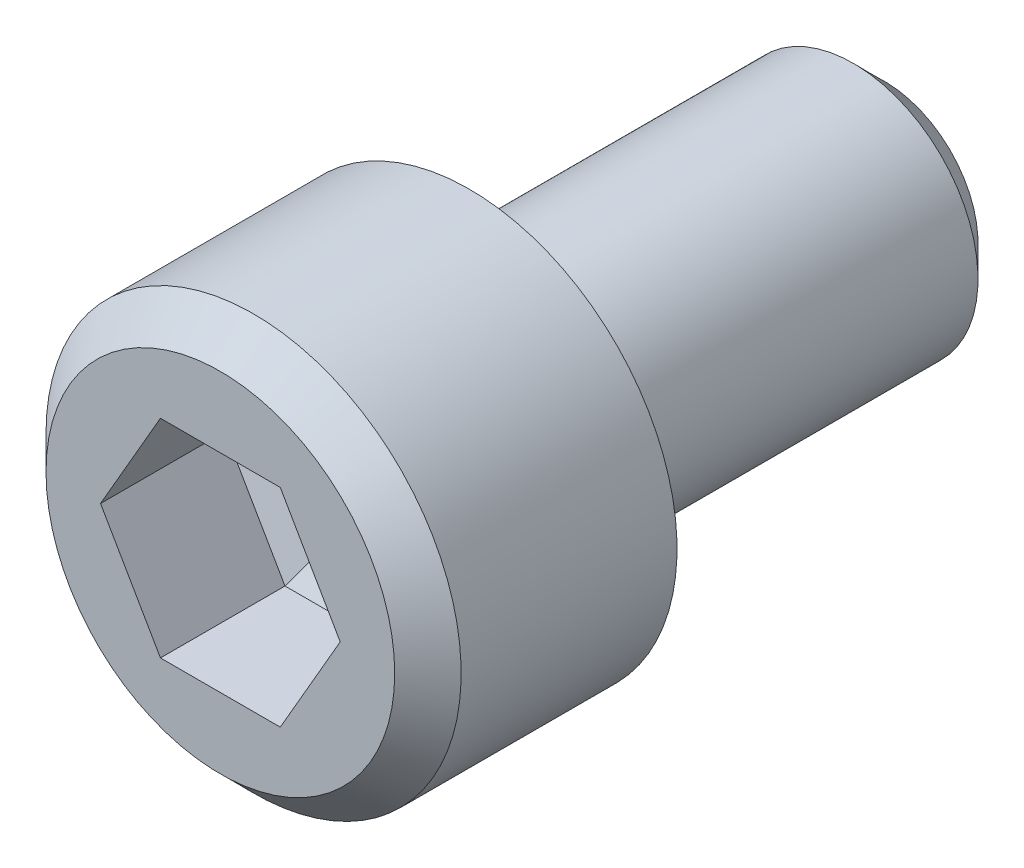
ISO-10303-21;
HEADER;
FILE_DESCRIPTION(('STEP AP214'),'2;1');
FILE_NAME('part.step','',(''),(''),'','','');
FILE_SCHEMA(('AUTOMOTIVE_DESIGN { 1 0 10303 214 1 1 1 1 }'));
ENDSEC;
DATA;
#1=APPLICATION_CONTEXT('core data for automotive mechanical design processes');
#2=APPLICATION_PROTOCOL_DEFINITION('international standard','automotive_design',2000,#1);
#3=PRODUCT_CONTEXT('',#1,'mechanical');
#4=PRODUCT('Part','Part','',(#3));
#5=PRODUCT_RELATED_PRODUCT_CATEGORY('part','',(#4));
#6=PRODUCT_DEFINITION_FORMATION('','',#4);
#7=PRODUCT_DEFINITION_CONTEXT('part definition',#1,'design');
#8=PRODUCT_DEFINITION('design','',#6,#7);
#9=PRODUCT_DEFINITION_SHAPE('','',#8);
#10=(LENGTH_UNIT() NAMED_UNIT(*) SI_UNIT(.MILLI.,.METRE.));
#11=(NAMED_UNIT(*) PLANE_ANGLE_UNIT() SI_UNIT($,.RADIAN.));
#12=(NAMED_UNIT(*) SI_UNIT($,.STERADIAN.) SOLID_ANGLE_UNIT());
#13=UNCERTAINTY_MEASURE_WITH_UNIT(LENGTH_MEASURE(1.E-05),#10,'distance_accuracy_value','');
#14=(GEOMETRIC_REPRESENTATION_CONTEXT(3) GLOBAL_UNCERTAINTY_ASSIGNED_CONTEXT((#13)) GLOBAL_UNIT_ASSIGNED_CONTEXT((#10,
#11,#12)) REPRESENTATION_CONTEXT('',''));
#15=CARTESIAN_POINT('',(0.,0.,0.));
#16=DIRECTION('',(0.,0.,1.));
#17=DIRECTION('',(1.,0.,0.));
#18=AXIS2_PLACEMENT_3D('',#15,#16,#17);
#19=CARTESIAN_POINT('',(37.5,1.7562446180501E-13,70.));
#20=DIRECTION('',(0.,0.,1.));
#21=DIRECTION('',(-1.,0.,0.));
#22=AXIS2_PLACEMENT_3D('',#19,#20,#21);
#23=PLANE('',#22);
#24=DIRECTION('',(-0.5,0.866025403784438,0.));
#25=VECTOR('',#24,1.);
#26=CARTESIAN_POINT('',(40.3867513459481,1.7562446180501E-13,70.));
#27=LINE('',#26,#25);
#28=CARTESIAN_POINT('',(40.3867513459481,1.7562446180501E-13,70.));
#29=VERTEX_POINT('',#28);
#30=CARTESIAN_POINT('',(38.9433756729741,2.50000000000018,70.));
#31=VERTEX_POINT('',#30);
#32=EDGE_CURVE('E291',#29,#31,#27,.T.);
#33=ORIENTED_EDGE('',*,*,#32,.F.);
#34=DIRECTION('',(0.5,0.866025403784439,0.));
#35=VECTOR('',#34,1.);
#36=CARTESIAN_POINT('',(38.9433756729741,-2.49999999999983,70.));
#37=LINE('',#36,#35);
#38=CARTESIAN_POINT('',(38.9433756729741,-2.49999999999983,70.));
#39=VERTEX_POINT('',#38);
#40=EDGE_CURVE('E88',#39,#29,#37,.T.);
#41=ORIENTED_EDGE('',*,*,#40,.F.);
#42=DIRECTION('',(1.,0.,0.));
#43=VECTOR('',#42,1.);
#44=CARTESIAN_POINT('',(36.056624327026,-2.49999999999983,70.));
#45=LINE('',#44,#43);
#46=CARTESIAN_POINT('',(36.056624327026,-2.49999999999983,70.));
#47=VERTEX_POINT('',#46);
#48=EDGE_CURVE('E31',#47,#39,#45,.T.);
#49=ORIENTED_EDGE('',*,*,#48,.F.);
#50=DIRECTION('',(0.5,-0.866025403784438,0.));
#51=VECTOR('',#50,1.);
#52=CARTESIAN_POINT('',(34.6132486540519,1.68963123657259E-13,70.));
#53=LINE('',#52,#51);
#54=CARTESIAN_POINT('',(34.6132486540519,1.68685567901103E-13,70.));
#55=VERTEX_POINT('',#54);
#56=EDGE_CURVE('E66',#55,#47,#53,.T.);
#57=ORIENTED_EDGE('',*,*,#56,.F.);
#58=DIRECTION('',(-0.5,-0.86602540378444,0.));
#59=VECTOR('',#58,1.);
#60=CARTESIAN_POINT('',(36.056624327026,2.50000000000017,70.));
#61=LINE('',#60,#59);
#62=CARTESIAN_POINT('',(36.056624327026,2.50000000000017,70.));
#63=VERTEX_POINT('',#62);
#64=EDGE_CURVE('E76',#63,#55,#61,.T.);
#65=ORIENTED_EDGE('',*,*,#64,.F.);
#66=DIRECTION('',(-1.,0.,0.));
#67=VECTOR('',#66,1.);
#68=CARTESIAN_POINT('',(38.9433756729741,2.50000000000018,70.));
#69=LINE('',#68,#67);
#70=EDGE_CURVE('E82',#31,#63,#69,.T.);
#71=ORIENTED_EDGE('',*,*,#70,.F.);
#72=EDGE_LOOP('',(#33,#41,#49,#57,#65,#71));
#73=FACE_BOUND('',#72,.T.);
#74=CARTESIAN_POINT('',(37.5,1.7562446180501E-13,70.));
#75=DIRECTION('',(0.,0.,1.));
#76=DIRECTION('',(-1.,0.,0.));
#77=AXIS2_PLACEMENT_3D('',#74,#75,#76);
#78=CIRCLE('',#77,4.2);
#79=CARTESIAN_POINT('',(33.3,1.7562446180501E-13,70.));
#80=VERTEX_POINT('',#79);
#81=EDGE_CURVE('E110',#80,#80,#78,.T.);
#82=ORIENTED_EDGE('',*,*,#81,.T.);
#83=EDGE_LOOP('',(#82));
#84=FACE_BOUND('',#83,.T.);
#85=ADVANCED_FACE('F16',(#73,#84),#23,.T.);
#86=CARTESIAN_POINT('',(37.5,1.7562446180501E-13,64.));
#87=DIRECTION('',(0.,0.,-1.));
#88=DIRECTION('',(1.,0.,0.));
#89=AXIS2_PLACEMENT_3D('',#86,#87,#88);
#90=PLANE('',#89);
#91=CARTESIAN_POINT('',(37.5,1.7562446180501E-13,64.));
#92=DIRECTION('',(0.,0.,-1.));
#93=DIRECTION('',(-1.,0.,0.));
#94=AXIS2_PLACEMENT_3D('',#91,#92,#93);
#95=CIRCLE('',#94,3.);
#96=CARTESIAN_POINT('',(34.5,1.7562446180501E-13,64.));
#97=VERTEX_POINT('',#96);
#98=EDGE_CURVE('E113',#97,#97,#95,.T.);
#99=ORIENTED_EDGE('',*,*,#98,.F.);
#100=EDGE_LOOP('',(#99));
#101=FACE_BOUND('',#100,.T.);
#102=CARTESIAN_POINT('',(37.5,1.7562446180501E-13,64.));
#103=DIRECTION('',(0.,0.,1.));
#104=DIRECTION('',(-1.,0.,0.));
#105=AXIS2_PLACEMENT_3D('',#102,#103,#104);
#106=CIRCLE('',#105,5.);
#107=CARTESIAN_POINT('',(32.5,1.7562446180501E-13,64.));
#108=VERTEX_POINT('',#107);
#109=EDGE_CURVE('E102',#108,#108,#106,.T.);
#110=ORIENTED_EDGE('',*,*,#109,.F.);
#111=EDGE_LOOP('',(#110));
#112=FACE_BOUND('',#111,.T.);
#113=ADVANCED_FACE('F132',(#101,#112),#90,.T.);
#114=CARTESIAN_POINT('',(37.5,1.7562446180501E-13,64.));
#115=DIRECTION('',(0.,0.,1.));
#116=DIRECTION('',(-1.,0.,0.));
#117=AXIS2_PLACEMENT_3D('',#114,#115,#116);
#118=CYLINDRICAL_SURFACE('',#117,5.);
#119=CARTESIAN_POINT('',(37.5,1.7562446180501E-13,69.2));
#120=DIRECTION('',(0.,0.,1.));
#121=DIRECTION('',(-1.,0.,0.));
#122=AXIS2_PLACEMENT_3D('',#119,#120,#121);
#123=CIRCLE('',#122,5.);
#124=CARTESIAN_POINT('',(32.5,1.7562446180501E-13,69.2));
#125=VERTEX_POINT('',#124);
#126=EDGE_CURVE('E107',#125,#125,#123,.F.);
#127=ORIENTED_EDGE('',*,*,#126,.T.);
#128=EDGE_LOOP('',(#127));
#129=FACE_BOUND('',#128,.T.);
#130=ORIENTED_EDGE('',*,*,#109,.T.);
#131=EDGE_LOOP('',(#130));
#132=FACE_BOUND('',#131,.T.);
#133=ADVANCED_FACE('F137',(#129,#132),#118,.T.);
#134=CARTESIAN_POINT('',(37.5,1.7562446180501E-13,69.2));
#135=DIRECTION('',(0.,0.,-1.));
#136=DIRECTION('',(1.,0.,0.));
#137=AXIS2_PLACEMENT_3D('',#134,#135,#136);
#138=CONICAL_SURFACE('',#137,5.,0.785398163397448);
#139=ORIENTED_EDGE('',*,*,#81,.F.);
#140=EDGE_LOOP('',(#139));
#141=FACE_BOUND('',#140,.T.);
#142=ORIENTED_EDGE('',*,*,#126,.F.);
#143=EDGE_LOOP('',(#142));
#144=FACE_BOUND('',#143,.T.);
#145=ADVANCED_FACE('F143',(#141,#144),#138,.T.);
#146=CARTESIAN_POINT('',(40.3867513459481,1.7562446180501E-13,67.));
#147=DIRECTION('',(0.866025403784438,0.5,0.));
#148=DIRECTION('',(0.5,-0.866025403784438,0.));
#149=AXIS2_PLACEMENT_3D('',#146,#147,#148);
#150=PLANE('',#149);
#151=ORIENTED_EDGE('',*,*,#32,.T.);
#152=DIRECTION('',(0.,0.,1.));
#153=VECTOR('',#152,1.);
#154=CARTESIAN_POINT('',(38.9433756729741,2.50000000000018,67.));
#155=LINE('',#154,#153);
#156=CARTESIAN_POINT('',(38.9433756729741,2.50000000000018,67.));
#157=VERTEX_POINT('',#156);
#158=EDGE_CURVE('E100',#157,#31,#155,.T.);
#159=ORIENTED_EDGE('',*,*,#158,.F.);
#160=DIRECTION('',(-0.5,0.866025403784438,0.));
#161=VECTOR('',#160,1.);
#162=CARTESIAN_POINT('',(40.3867513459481,1.7562446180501E-13,67.));
#163=LINE('',#162,#161);
#164=CARTESIAN_POINT('',(40.3867513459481,1.7562446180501E-13,67.));
#165=VERTEX_POINT('',#164);
#166=EDGE_CURVE('E94',#165,#157,#163,.T.);
#167=ORIENTED_EDGE('',*,*,#166,.F.);
#168=DIRECTION('',(0.,0.,1.));
#169=VECTOR('',#168,1.);
#170=CARTESIAN_POINT('',(40.3867513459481,1.7562446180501E-13,67.));
#171=LINE('',#170,#169);
#172=EDGE_CURVE('E97',#165,#29,#171,.T.);
#173=ORIENTED_EDGE('',*,*,#172,.T.);
#174=EDGE_LOOP('',(#151,#159,#167,#173));
#175=FACE_BOUND('',#174,.T.);
#176=ADVANCED_FACE('F146',(#175),#150,.F.);
#177=CARTESIAN_POINT('',(38.9433756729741,2.50000000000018,67.));
#178=DIRECTION('',(0.,1.,0.));
#179=DIRECTION('',(1.,0.,0.));
#180=AXIS2_PLACEMENT_3D('',#177,#178,#179);
#181=PLANE('',#180);
#182=ORIENTED_EDGE('',*,*,#70,.T.);
#183=DIRECTION('',(0.,0.,1.));
#184=VECTOR('',#183,1.);
#185=CARTESIAN_POINT('',(36.056624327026,2.50000000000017,67.));
#186=LINE('',#185,#184);
#187=CARTESIAN_POINT('',(36.056624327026,2.50000000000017,67.));
#188=VERTEX_POINT('',#187);
#189=EDGE_CURVE('E72',#188,#63,#186,.T.);
#190=ORIENTED_EDGE('',*,*,#189,.F.);
#191=DIRECTION('',(-1.,0.,0.));
#192=VECTOR('',#191,1.);
#193=CARTESIAN_POINT('',(38.9433756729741,2.50000000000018,67.));
#194=LINE('',#193,#192);
#195=EDGE_CURVE('E288',#157,#188,#194,.T.);
#196=ORIENTED_EDGE('',*,*,#195,.F.);
#197=ORIENTED_EDGE('',*,*,#158,.T.);
#198=EDGE_LOOP('',(#182,#190,#196,#197));
#199=FACE_BOUND('',#198,.T.);
#200=ADVANCED_FACE('F151',(#199),#181,.F.);
#201=CARTESIAN_POINT('',(36.056624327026,2.50000000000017,67.));
#202=DIRECTION('',(-0.86602540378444,0.5,0.));
#203=DIRECTION('',(0.5,0.86602540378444,0.));
#204=AXIS2_PLACEMENT_3D('',#201,#202,#203);
#205=PLANE('',#204);
#206=ORIENTED_EDGE('',*,*,#64,.T.);
#207=DIRECTION('',(0.,0.,1.));
#208=VECTOR('',#207,1.);
#209=CARTESIAN_POINT('',(34.6132486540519,1.68685567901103E-13,67.));
#210=LINE('',#209,#208);
#211=CARTESIAN_POINT('',(34.6132486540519,1.68685567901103E-13,67.));
#212=VERTEX_POINT('',#211);
#213=EDGE_CURVE('E61',#212,#55,#210,.T.);
#214=ORIENTED_EDGE('',*,*,#213,.F.);
#215=DIRECTION('',(-0.5,-0.86602540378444,0.));
#216=VECTOR('',#215,1.);
#217=CARTESIAN_POINT('',(36.056624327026,2.50000000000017,67.));
#218=LINE('',#217,#216);
#219=EDGE_CURVE('E294',#188,#212,#218,.T.);
#220=ORIENTED_EDGE('',*,*,#219,.F.);
#221=ORIENTED_EDGE('',*,*,#189,.T.);
#222=EDGE_LOOP('',(#206,#214,#220,#221));
#223=FACE_BOUND('',#222,.T.);
#224=ADVANCED_FACE('F77',(#223),#205,.F.);
#225=CARTESIAN_POINT('',(34.6132486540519,1.68963123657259E-13,67.));
#226=DIRECTION('',(-0.866025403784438,-0.5,0.));
#227=DIRECTION('',(-0.5,0.866025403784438,0.));
#228=AXIS2_PLACEMENT_3D('',#225,#226,#227);
#229=PLANE('',#228);
#230=ORIENTED_EDGE('',*,*,#56,.T.);
#231=DIRECTION('',(0.,0.,1.));
#232=VECTOR('',#231,1.);
#233=CARTESIAN_POINT('',(36.056624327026,-2.49999999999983,67.));
#234=LINE('',#233,#232);
#235=CARTESIAN_POINT('',(36.056624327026,-2.49999999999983,67.));
#236=VERTEX_POINT('',#235);
#237=EDGE_CURVE('E73',#236,#47,#234,.T.);
#238=ORIENTED_EDGE('',*,*,#237,.F.);
#239=DIRECTION('',(0.5,-0.866025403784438,0.));
#240=VECTOR('',#239,1.);
#241=CARTESIAN_POINT('',(34.6132486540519,1.68963123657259E-13,67.));
#242=LINE('',#241,#240);
#243=EDGE_CURVE('E69',#212,#236,#242,.T.);
#244=ORIENTED_EDGE('',*,*,#243,.F.);
#245=ORIENTED_EDGE('',*,*,#213,.T.);
#246=EDGE_LOOP('',(#230,#238,#244,#245));
#247=FACE_BOUND('',#246,.T.);
#248=ADVANCED_FACE('F63',(#247),#229,.F.);
#249=CARTESIAN_POINT('',(36.056624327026,-2.49999999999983,67.));
#250=DIRECTION('',(0.,-1.,0.));
#251=DIRECTION('',(-1.,0.,0.));
#252=AXIS2_PLACEMENT_3D('',#249,#250,#251);
#253=PLANE('',#252);
#254=ORIENTED_EDGE('',*,*,#48,.T.);
#255=DIRECTION('',(0.,0.,1.));
#256=VECTOR('',#255,1.);
#257=CARTESIAN_POINT('',(38.9433756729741,-2.49999999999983,67.));
#258=LINE('',#257,#256);
#259=CARTESIAN_POINT('',(38.9433756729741,-2.49999999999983,67.));
#260=VERTEX_POINT('',#259);
#261=EDGE_CURVE('E95',#260,#39,#258,.T.);
#262=ORIENTED_EDGE('',*,*,#261,.F.);
#263=DIRECTION('',(1.,0.,0.));
#264=VECTOR('',#263,1.);
#265=CARTESIAN_POINT('',(36.056624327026,-2.49999999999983,67.));
#266=LINE('',#265,#264);
#267=EDGE_CURVE('E40',#236,#260,#266,.T.);
#268=ORIENTED_EDGE('',*,*,#267,.F.);
#269=ORIENTED_EDGE('',*,*,#237,.T.);
#270=EDGE_LOOP('',(#254,#262,#268,#269));
#271=FACE_BOUND('',#270,.T.);
#272=ADVANCED_FACE('F170',(#271),#253,.F.);
#273=CARTESIAN_POINT('',(38.9433756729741,-2.49999999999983,67.));
#274=DIRECTION('',(0.866025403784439,-0.5,0.));
#275=DIRECTION('',(-0.5,-0.866025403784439,0.));
#276=AXIS2_PLACEMENT_3D('',#273,#274,#275);
#277=PLANE('',#276);
#278=ORIENTED_EDGE('',*,*,#40,.T.);
#279=ORIENTED_EDGE('',*,*,#172,.F.);
#280=DIRECTION('',(0.5,0.866025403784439,0.));
#281=VECTOR('',#280,1.);
#282=CARTESIAN_POINT('',(38.9433756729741,-2.49999999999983,67.));
#283=LINE('',#282,#281);
#284=EDGE_CURVE('E104',#260,#165,#283,.T.);
#285=ORIENTED_EDGE('',*,*,#284,.F.);
#286=ORIENTED_EDGE('',*,*,#261,.T.);
#287=EDGE_LOOP('',(#278,#279,#285,#286));
#288=FACE_BOUND('',#287,.T.);
#289=ADVANCED_FACE('F173',(#288),#277,.F.);
#290=CARTESIAN_POINT('',(40.3867513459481,1.7562446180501E-13,67.));
#291=DIRECTION('',(0.433012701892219,0.25,-0.866025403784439));
#292=DIRECTION('',(0.894427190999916,0.,0.447213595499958));
#293=AXIS2_PLACEMENT_3D('',#290,#291,#292);
#294=PLANE('',#293);
#295=ORIENTED_EDGE('',*,*,#166,.T.);
#296=DIRECTION('',(0.447213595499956,0.774596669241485,0.447213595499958));
#297=VECTOR('',#296,1.);
#298=CARTESIAN_POINT('',(38.3660254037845,1.50000000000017,66.4226497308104));
#299=LINE('',#298,#297);
#300=CARTESIAN_POINT('',(37.5,1.75699651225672E-13,65.5566243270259));
#301=VERTEX_POINT('',#300);
#302=EDGE_CURVE('E281',#301,#157,#299,.T.);
#303=ORIENTED_EDGE('',*,*,#302,.F.);
#304=DIRECTION('',(0.894427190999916,0.,0.447213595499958));
#305=VECTOR('',#304,1.);
#306=CARTESIAN_POINT('',(39.2320508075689,1.73456057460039E-13,66.4226497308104));
#307=LINE('',#306,#305);
#308=EDGE_CURVE('E284',#301,#165,#307,.T.);
#309=ORIENTED_EDGE('',*,*,#308,.T.);
#310=EDGE_LOOP('',(#295,#303,#309));
#311=FACE_BOUND('',#310,.T.);
#312=ADVANCED_FACE('F176',(#311),#294,.F.);
#313=CARTESIAN_POINT('',(38.9433756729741,2.50000000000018,67.));
#314=DIRECTION('',(0.,0.5,-0.866025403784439));
#315=DIRECTION('',(0.,0.866025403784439,0.5));
#316=AXIS2_PLACEMENT_3D('',#313,#314,#315);
#317=PLANE('',#316);
#318=ORIENTED_EDGE('',*,*,#195,.T.);
#319=DIRECTION('',(-0.447213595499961,0.774596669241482,0.447213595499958));
#320=VECTOR('',#319,1.);
#321=CARTESIAN_POINT('',(36.6339745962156,1.50000000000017,66.4226497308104));
#322=LINE('',#321,#320);
#323=EDGE_CURVE('E314',#301,#188,#322,.T.);
#324=ORIENTED_EDGE('',*,*,#323,.F.);
#325=ORIENTED_EDGE('',*,*,#302,.T.);
#326=EDGE_LOOP('',(#318,#324,#325));
#327=FACE_BOUND('',#326,.T.);
#328=ADVANCED_FACE('F192',(#327),#317,.F.);
#329=CARTESIAN_POINT('',(36.056624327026,2.50000000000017,67.));
#330=DIRECTION('',(-0.43301270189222,0.25,-0.866025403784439));
#331=DIRECTION('',(0.894427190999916,0.,-0.447213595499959));
#332=AXIS2_PLACEMENT_3D('',#329,#330,#331);
#333=PLANE('',#332);
#334=ORIENTED_EDGE('',*,*,#219,.T.);
#335=DIRECTION('',(-0.894427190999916,0.,0.447213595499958));
#336=VECTOR('',#335,1.);
#337=CARTESIAN_POINT('',(35.7679491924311,1.72155014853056E-13,66.4226497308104));
#338=LINE('',#337,#336);
#339=EDGE_CURVE('E315',#301,#212,#338,.T.);
#340=ORIENTED_EDGE('',*,*,#339,.F.);
#341=ORIENTED_EDGE('',*,*,#323,.T.);
#342=EDGE_LOOP('',(#334,#340,#341));
#343=FACE_BOUND('',#342,.T.);
#344=ADVANCED_FACE('F188',(#343),#333,.F.);
#345=CARTESIAN_POINT('',(34.6132486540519,1.68963123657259E-13,67.));
#346=DIRECTION('',(-0.433012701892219,-0.25,-0.866025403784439));
#347=DIRECTION('',(0.894427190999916,0.,-0.447213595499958));
#348=AXIS2_PLACEMENT_3D('',#345,#346,#347);
#349=PLANE('',#348);
#350=ORIENTED_EDGE('',*,*,#243,.T.);
#351=DIRECTION('',(-0.447213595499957,-0.774596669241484,0.447213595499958));
#352=VECTOR('',#351,1.);
#353=CARTESIAN_POINT('',(36.6339745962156,-1.49999999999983,66.4226497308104));
#354=LINE('',#353,#352);
#355=EDGE_CURVE('E308',#301,#236,#354,.T.);
#356=ORIENTED_EDGE('',*,*,#355,.F.);
#357=ORIENTED_EDGE('',*,*,#339,.T.);
#358=EDGE_LOOP('',(#350,#356,#357));
#359=FACE_BOUND('',#358,.T.);
#360=ADVANCED_FACE('F185',(#359),#349,.F.);
#361=CARTESIAN_POINT('',(36.056624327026,-2.49999999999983,67.));
#362=DIRECTION('',(0.,-0.5,-0.866025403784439));
#363=DIRECTION('',(0.,0.866025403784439,-0.5));
#364=AXIS2_PLACEMENT_3D('',#361,#362,#363);
#365=PLANE('',#364);
#366=ORIENTED_EDGE('',*,*,#267,.T.);
#367=DIRECTION('',(0.447213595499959,-0.774596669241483,0.447213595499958));
#368=VECTOR('',#367,1.);
#369=CARTESIAN_POINT('',(38.3660254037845,-1.49999999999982,66.4226497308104));
#370=LINE('',#369,#368);
#371=EDGE_CURVE('E321',#301,#260,#370,.T.);
#372=ORIENTED_EDGE('',*,*,#371,.F.);
#373=ORIENTED_EDGE('',*,*,#355,.T.);
#374=EDGE_LOOP('',(#366,#372,#373));
#375=FACE_BOUND('',#374,.T.);
#376=ADVANCED_FACE('F181',(#375),#365,.F.);
#377=CARTESIAN_POINT('',(38.9433756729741,-2.49999999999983,67.));
#378=DIRECTION('',(0.43301270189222,-0.25,-0.866025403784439));
#379=DIRECTION('',(0.894427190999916,0.,0.447213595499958));
#380=AXIS2_PLACEMENT_3D('',#377,#378,#379);
#381=PLANE('',#380);
#382=ORIENTED_EDGE('',*,*,#284,.T.);
#383=ORIENTED_EDGE('',*,*,#308,.F.);
#384=ORIENTED_EDGE('',*,*,#371,.T.);
#385=EDGE_LOOP('',(#382,#383,#384));
#386=FACE_BOUND('',#385,.T.);
#387=ADVANCED_FACE('F178',(#386),#381,.F.);
#388=CARTESIAN_POINT('',(37.5,1.7562446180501E-13,54.));
#389=DIRECTION('',(0.,0.,1.));
#390=DIRECTION('',(1.,0.,0.));
#391=AXIS2_PLACEMENT_3D('',#388,#389,#390);
#392=CYLINDRICAL_SURFACE('',#391,3.);
#393=CARTESIAN_POINT('',(37.5,1.7562446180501E-13,54.75));
#394=DIRECTION('',(0.,0.,-1.));
#395=DIRECTION('',(-1.,0.,0.));
#396=AXIS2_PLACEMENT_3D('',#393,#394,#395);
#397=CIRCLE('',#396,3.);
#398=CARTESIAN_POINT('',(34.5,1.7562446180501E-13,54.75));
#399=VERTEX_POINT('',#398);
#400=EDGE_CURVE('E24',#399,#399,#397,.F.);
#401=ORIENTED_EDGE('',*,*,#400,.T.);
#402=EDGE_LOOP('',(#401));
#403=FACE_BOUND('',#402,.T.);
#404=ORIENTED_EDGE('',*,*,#98,.T.);
#405=EDGE_LOOP('',(#404));
#406=FACE_BOUND('',#405,.T.);
#407=ADVANCED_FACE('F118',(#403,#406),#392,.T.);
#408=CARTESIAN_POINT('',(37.5,1.7562446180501E-13,54.));
#409=DIRECTION('',(0.,0.,-1.));
#410=DIRECTION('',(1.,0.,0.));
#411=AXIS2_PLACEMENT_3D('',#408,#409,#410);
#412=PLANE('',#411);
#413=CARTESIAN_POINT('',(37.5,1.7562446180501E-13,54.));
#414=DIRECTION('',(0.,0.,-1.));
#415=DIRECTION('',(-1.,0.,0.));
#416=AXIS2_PLACEMENT_3D('',#413,#414,#415);
#417=CIRCLE('',#416,2.25);
#418=CARTESIAN_POINT('',(35.25,1.7562446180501E-13,54.));
#419=VERTEX_POINT('',#418);
#420=EDGE_CURVE('E11',#419,#419,#417,.T.);
#421=ORIENTED_EDGE('',*,*,#420,.T.);
#422=EDGE_LOOP('',(#421));
#423=FACE_BOUND('',#422,.T.);
#424=ADVANCED_FACE('F122',(#423),#412,.T.);
#425=CARTESIAN_POINT('',(37.5,1.7562446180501E-13,54.75));
#426=DIRECTION('',(0.,0.,1.));
#427=DIRECTION('',(1.,0.,0.));
#428=AXIS2_PLACEMENT_3D('',#425,#426,#427);
#429=CONICAL_SURFACE('',#428,3.,0.785398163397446);
#430=ORIENTED_EDGE('',*,*,#420,.F.);
#431=EDGE_LOOP('',(#430));
#432=FACE_BOUND('',#431,.T.);
#433=ORIENTED_EDGE('',*,*,#400,.F.);
#434=EDGE_LOOP('',(#433));
#435=FACE_BOUND('',#434,.T.);
#436=ADVANCED_FACE('F18',(#432,#435),#429,.T.);
#437=CLOSED_SHELL('',(#85,#113,#133,#145,#176,#200,#224,#248,#272,#289,#312,#328,#344,#360,#376,
#387,#407,#424,#436));
#438=MANIFOLD_SOLID_BREP('B1',#437);
#439=ADVANCED_BREP_SHAPE_REPRESENTATION('',(#18,#438),#14);
#440=SHAPE_DEFINITION_REPRESENTATION(#9,#439);
ENDSEC;
END-ISO-10303-21;
